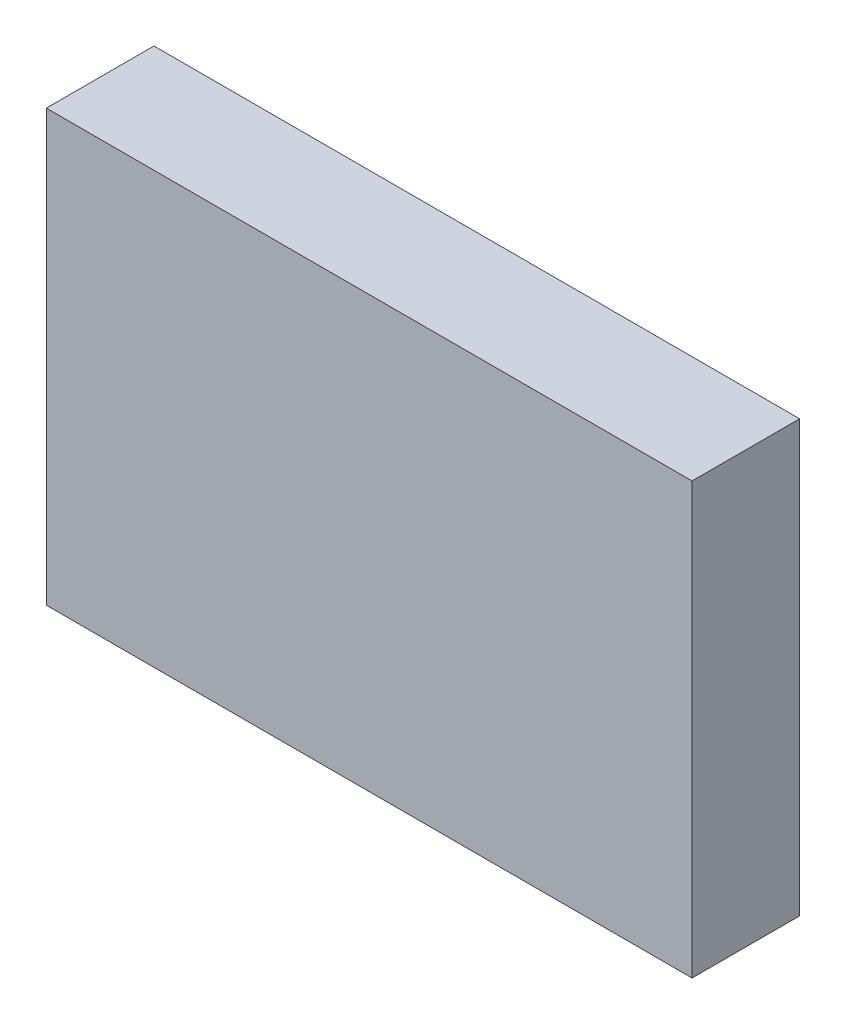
ISO-10303-21;
HEADER;
FILE_DESCRIPTION(('STEP AP214'),'2;1');
FILE_NAME('part.step','',(''),(''),'','','');
FILE_SCHEMA(('AUTOMOTIVE_DESIGN { 1 0 10303 214 1 1 1 1 }'));
ENDSEC;
DATA;
#1=APPLICATION_CONTEXT('core data for automotive mechanical design processes');
#2=APPLICATION_PROTOCOL_DEFINITION('international standard','automotive_design',2000,#1);
#3=PRODUCT_CONTEXT('',#1,'mechanical');
#4=PRODUCT('Part','Part','',(#3));
#5=PRODUCT_RELATED_PRODUCT_CATEGORY('part','',(#4));
#6=PRODUCT_DEFINITION_FORMATION('','',#4);
#7=PRODUCT_DEFINITION_CONTEXT('part definition',#1,'design');
#8=PRODUCT_DEFINITION('design','',#6,#7);
#9=PRODUCT_DEFINITION_SHAPE('','',#8);
#10=(LENGTH_UNIT() NAMED_UNIT(*) SI_UNIT(.MILLI.,.METRE.));
#11=(NAMED_UNIT(*) PLANE_ANGLE_UNIT() SI_UNIT($,.RADIAN.));
#12=(NAMED_UNIT(*) SI_UNIT($,.STERADIAN.) SOLID_ANGLE_UNIT());
#13=UNCERTAINTY_MEASURE_WITH_UNIT(LENGTH_MEASURE(1.E-05),#10,'distance_accuracy_value','');
#14=(GEOMETRIC_REPRESENTATION_CONTEXT(3) GLOBAL_UNCERTAINTY_ASSIGNED_CONTEXT((#13)) GLOBAL_UNIT_ASSIGNED_CONTEXT((#10,
#11,#12)) REPRESENTATION_CONTEXT('',''));
#15=CARTESIAN_POINT('',(0.,0.,0.));
#16=DIRECTION('',(0.,0.,1.));
#17=DIRECTION('',(1.,0.,0.));
#18=AXIS2_PLACEMENT_3D('',#15,#16,#17);
#19=CARTESIAN_POINT('',(150.,-100.,-50.));
#20=DIRECTION('',(1.,0.,0.));
#21=DIRECTION('',(0.,0.,-1.));
#22=AXIS2_PLACEMENT_3D('',#19,#20,#21);
#23=PLANE('',#22);
#24=DIRECTION('',(0.,1.,0.));
#25=VECTOR('',#24,1.);
#26=CARTESIAN_POINT('',(150.,-100.,0.));
#27=LINE('',#26,#25);
#28=CARTESIAN_POINT('',(150.,-100.,0.));
#29=VERTEX_POINT('',#28);
#30=CARTESIAN_POINT('',(150.,100.,0.));
#31=VERTEX_POINT('',#30);
#32=EDGE_CURVE('E103',#29,#31,#27,.T.);
#33=ORIENTED_EDGE('',*,*,#32,.F.);
#34=DIRECTION('',(0.,0.,1.));
#35=VECTOR('',#34,1.);
#36=CARTESIAN_POINT('',(150.,-100.,-50.));
#37=LINE('',#36,#35);
#38=CARTESIAN_POINT('',(150.,-100.,-50.));
#39=VERTEX_POINT('',#38);
#40=EDGE_CURVE('E11',#39,#29,#37,.T.);
#41=ORIENTED_EDGE('',*,*,#40,.F.);
#42=DIRECTION('',(0.,1.,0.));
#43=VECTOR('',#42,1.);
#44=CARTESIAN_POINT('',(150.,-100.,-50.));
#45=LINE('',#44,#43);
#46=CARTESIAN_POINT('',(150.,100.,-50.));
#47=VERTEX_POINT('',#46);
#48=EDGE_CURVE('E100',#39,#47,#45,.T.);
#49=ORIENTED_EDGE('',*,*,#48,.T.);
#50=DIRECTION('',(0.,0.,1.));
#51=VECTOR('',#50,1.);
#52=CARTESIAN_POINT('',(150.,100.,-50.));
#53=LINE('',#52,#51);
#54=EDGE_CURVE('E45',#47,#31,#53,.T.);
#55=ORIENTED_EDGE('',*,*,#54,.T.);
#56=EDGE_LOOP('',(#33,#41,#49,#55));
#57=FACE_BOUND('',#56,.T.);
#58=ADVANCED_FACE('F39',(#57),#23,.T.);
#59=CARTESIAN_POINT('',(-150.,-100.,-50.));
#60=DIRECTION('',(0.,-1.,0.));
#61=DIRECTION('',(0.,0.,-1.));
#62=AXIS2_PLACEMENT_3D('',#59,#60,#61);
#63=PLANE('',#62);
#64=DIRECTION('',(1.,0.,0.));
#65=VECTOR('',#64,1.);
#66=CARTESIAN_POINT('',(-150.,-100.,0.));
#67=LINE('',#66,#65);
#68=CARTESIAN_POINT('',(-150.,-100.,0.));
#69=VERTEX_POINT('',#68);
#70=EDGE_CURVE('E97',#69,#29,#67,.T.);
#71=ORIENTED_EDGE('',*,*,#70,.F.);
#72=DIRECTION('',(0.,0.,1.));
#73=VECTOR('',#72,1.);
#74=CARTESIAN_POINT('',(-150.,-100.,-50.));
#75=LINE('',#74,#73);
#76=CARTESIAN_POINT('',(-150.,-100.,-50.));
#77=VERTEX_POINT('',#76);
#78=EDGE_CURVE('E48',#77,#69,#75,.T.);
#79=ORIENTED_EDGE('',*,*,#78,.F.);
#80=DIRECTION('',(1.,0.,0.));
#81=VECTOR('',#80,1.);
#82=CARTESIAN_POINT('',(-150.,-100.,-50.));
#83=LINE('',#82,#81);
#84=EDGE_CURVE('E94',#77,#39,#83,.T.);
#85=ORIENTED_EDGE('',*,*,#84,.T.);
#86=ORIENTED_EDGE('',*,*,#40,.T.);
#87=EDGE_LOOP('',(#71,#79,#85,#86));
#88=FACE_BOUND('',#87,.T.);
#89=ADVANCED_FACE('F114',(#88),#63,.T.);
#90=CARTESIAN_POINT('',(-150.,-100.,-50.));
#91=DIRECTION('',(-1.,0.,0.));
#92=DIRECTION('',(0.,0.,1.));
#93=AXIS2_PLACEMENT_3D('',#90,#91,#92);
#94=PLANE('',#93);
#95=DIRECTION('',(0.,-1.,0.));
#96=VECTOR('',#95,1.);
#97=CARTESIAN_POINT('',(-150.,-100.,0.));
#98=LINE('',#97,#96);
#99=CARTESIAN_POINT('',(-150.,100.,0.));
#100=VERTEX_POINT('',#99);
#101=EDGE_CURVE('E90',#100,#69,#98,.T.);
#102=ORIENTED_EDGE('',*,*,#101,.F.);
#103=DIRECTION('',(0.,0.,1.));
#104=VECTOR('',#103,1.);
#105=CARTESIAN_POINT('',(-150.,100.,-50.));
#106=LINE('',#105,#104);
#107=CARTESIAN_POINT('',(-150.,100.,-50.));
#108=VERTEX_POINT('',#107);
#109=EDGE_CURVE('E81',#108,#100,#106,.T.);
#110=ORIENTED_EDGE('',*,*,#109,.F.);
#111=DIRECTION('',(0.,-1.,0.));
#112=VECTOR('',#111,1.);
#113=CARTESIAN_POINT('',(-150.,-100.,-50.));
#114=LINE('',#113,#112);
#115=EDGE_CURVE('E87',#108,#77,#114,.T.);
#116=ORIENTED_EDGE('',*,*,#115,.T.);
#117=ORIENTED_EDGE('',*,*,#78,.T.);
#118=EDGE_LOOP('',(#102,#110,#116,#117));
#119=FACE_BOUND('',#118,.T.);
#120=ADVANCED_FACE('F88',(#119),#94,.T.);
#121=CARTESIAN_POINT('',(-150.,100.,-50.));
#122=DIRECTION('',(0.,1.,0.));
#123=DIRECTION('',(0.,0.,1.));
#124=AXIS2_PLACEMENT_3D('',#121,#122,#123);
#125=PLANE('',#124);
#126=DIRECTION('',(-1.,0.,0.));
#127=VECTOR('',#126,1.);
#128=CARTESIAN_POINT('',(-150.,100.,0.));
#129=LINE('',#128,#127);
#130=EDGE_CURVE('E106',#31,#100,#129,.T.);
#131=ORIENTED_EDGE('',*,*,#130,.F.);
#132=ORIENTED_EDGE('',*,*,#54,.F.);
#133=DIRECTION('',(-1.,0.,0.));
#134=VECTOR('',#133,1.);
#135=CARTESIAN_POINT('',(-150.,100.,-50.));
#136=LINE('',#135,#134);
#137=EDGE_CURVE('E91',#47,#108,#136,.T.);
#138=ORIENTED_EDGE('',*,*,#137,.T.);
#139=ORIENTED_EDGE('',*,*,#109,.T.);
#140=EDGE_LOOP('',(#131,#132,#138,#139));
#141=FACE_BOUND('',#140,.T.);
#142=ADVANCED_FACE('F96',(#141),#125,.T.);
#143=CARTESIAN_POINT('',(0.,0.,-50.));
#144=DIRECTION('',(0.,0.,-1.));
#145=DIRECTION('',(-1.,0.,0.));
#146=AXIS2_PLACEMENT_3D('',#143,#144,#145);
#147=PLANE('',#146);
#148=ORIENTED_EDGE('',*,*,#48,.F.);
#149=ORIENTED_EDGE('',*,*,#84,.F.);
#150=ORIENTED_EDGE('',*,*,#115,.F.);
#151=ORIENTED_EDGE('',*,*,#137,.F.);
#152=EDGE_LOOP('',(#148,#149,#150,#151));
#153=FACE_BOUND('',#152,.T.);
#154=ADVANCED_FACE('F95',(#153),#147,.T.);
#155=CARTESIAN_POINT('',(0.,0.,0.));
#156=DIRECTION('',(0.,0.,-1.));
#157=DIRECTION('',(-1.,0.,0.));
#158=AXIS2_PLACEMENT_3D('',#155,#156,#157);
#159=PLANE('',#158);
#160=ORIENTED_EDGE('',*,*,#32,.T.);
#161=ORIENTED_EDGE('',*,*,#130,.T.);
#162=ORIENTED_EDGE('',*,*,#101,.T.);
#163=ORIENTED_EDGE('',*,*,#70,.T.);
#164=EDGE_LOOP('',(#160,#161,#162,#163));
#165=FACE_BOUND('',#164,.T.);
#166=ADVANCED_FACE('F115',(#165),#159,.F.);
#167=CLOSED_SHELL('',(#58,#89,#120,#142,#154,#166));
#168=MANIFOLD_SOLID_BREP('B2',#167);
#169=ADVANCED_BREP_SHAPE_REPRESENTATION('',(#18,#168),#14);
#170=SHAPE_DEFINITION_REPRESENTATION(#9,#169);
ENDSEC;
END-ISO-10303-21;
